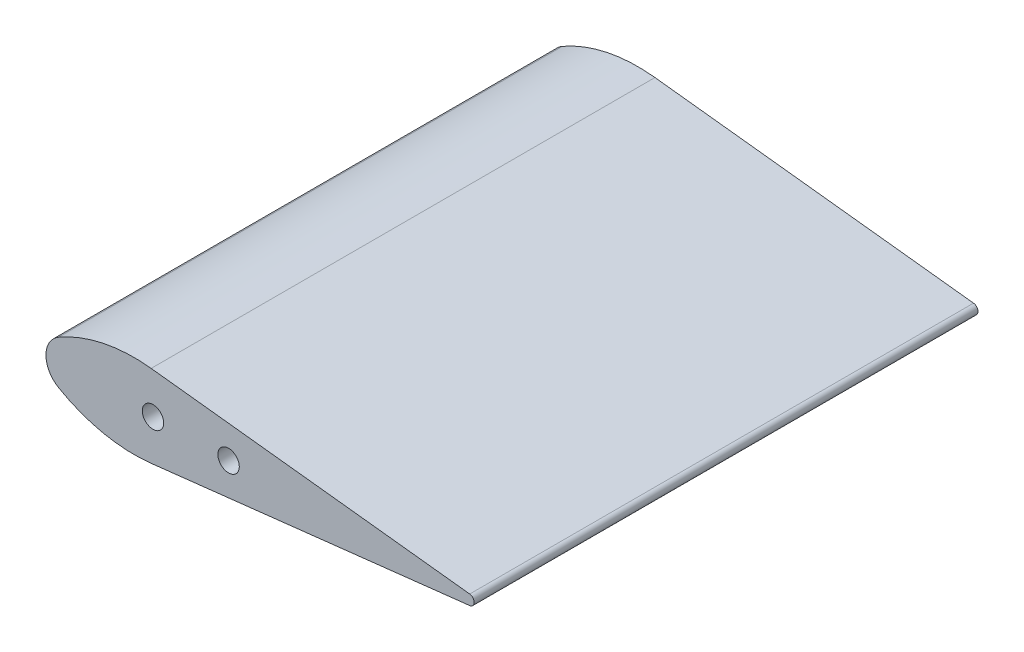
from build123d import *

# Parameters (mm, degrees)
EXTRUSION1_DEPTH           = 200
TROU_TARAUD_M10X1_52_D     = 8.5
TROU_TARAUD_M10X1_52_DEPTH = 24.5
TROU_TARAUD_M10X1_52_TIP   = 2.553657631


with BuildPart() as part:
    # Esquisse1 → Extrusion1 (new body)
    with BuildSketch(Plane.XY):
        with BuildLine():
            Line((-128.244792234, 16.317243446), (-1.774826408, 1.987283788))
            ThreePointArc((-1.774826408, 1.987283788), (-0.508298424, 1.33222611), (0, 0))
            Line((0, 0), (-170, 0))
            ThreePointArc((-170, 0), (-168.660254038, 5), (-165, 8.660254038))
            ThreePointArc((-165, 8.660254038), (-147.236726, 15.437665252), (-128.244792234, 16.317243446))
        make_face()
    extrusion1 = extrude(amount=EXTRUSION1_DEPTH)

    # Sym_trie1: Extrusion1 across plane
    add(extrusion1.mirror(Plane(origin=(-170, 0, 200), x_dir=(0, 0, 1), z_dir=(0, 1, 0))))

    # Trou taraud_ M10x1.52
    with Locations(Plane.XY.offset(200)):
        with Locations((-127.5, 0), (-97.5, 0)):
            Hole(TROU_TARAUD_M10X1_52_D / 2, depth=TROU_TARAUD_M10X1_52_DEPTH)
            with Locations((0, 0, -(TROU_TARAUD_M10X1_52_DEPTH + TROU_TARAUD_M10X1_52_TIP / 2))):  # 118° drill point
                Cone(0, TROU_TARAUD_M10X1_52_D / 2, TROU_TARAUD_M10X1_52_TIP, mode=Mode.SUBTRACT)


solid = part.part
